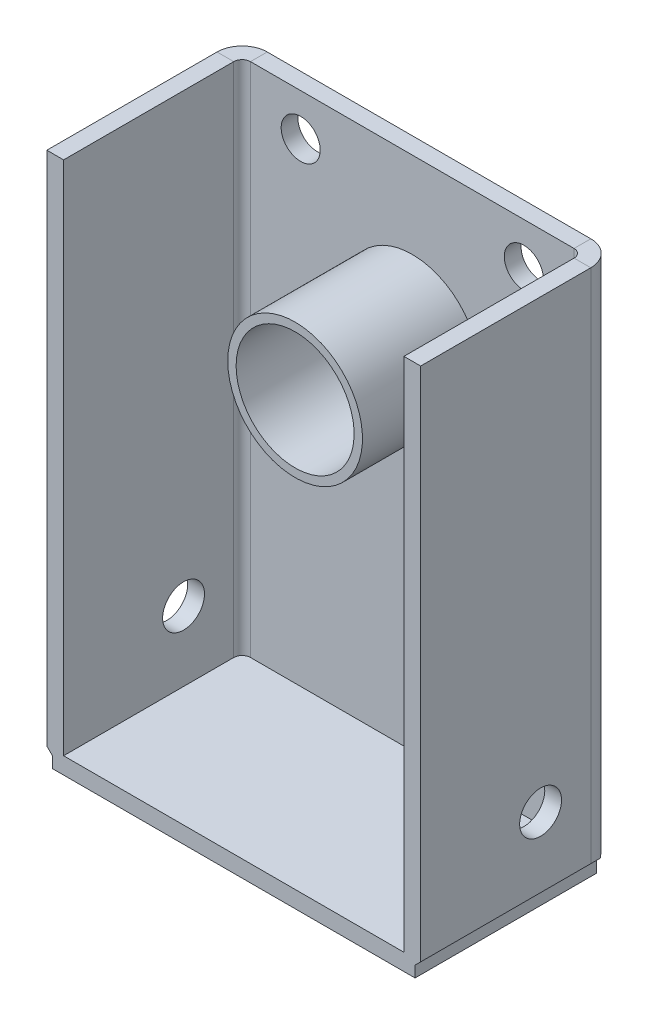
ISO-10303-21;
HEADER;
FILE_DESCRIPTION(('STEP AP214'),'2;1');
FILE_NAME('part.step','',(''),(''),'','','');
FILE_SCHEMA(('AUTOMOTIVE_DESIGN { 1 0 10303 214 1 1 1 1 }'));
ENDSEC;
DATA;
#1=APPLICATION_CONTEXT('core data for automotive mechanical design processes');
#2=APPLICATION_PROTOCOL_DEFINITION('international standard','automotive_design',2000,#1);
#3=PRODUCT_CONTEXT('',#1,'mechanical');
#4=PRODUCT('Part','Part','',(#3));
#5=PRODUCT_RELATED_PRODUCT_CATEGORY('part','',(#4));
#6=PRODUCT_DEFINITION_FORMATION('','',#4);
#7=PRODUCT_DEFINITION_CONTEXT('part definition',#1,'design');
#8=PRODUCT_DEFINITION('design','',#6,#7);
#9=PRODUCT_DEFINITION_SHAPE('','',#8);
#10=(LENGTH_UNIT() NAMED_UNIT(*) SI_UNIT(.MILLI.,.METRE.));
#11=(NAMED_UNIT(*) PLANE_ANGLE_UNIT() SI_UNIT($,.RADIAN.));
#12=(NAMED_UNIT(*) SI_UNIT($,.STERADIAN.) SOLID_ANGLE_UNIT());
#13=UNCERTAINTY_MEASURE_WITH_UNIT(LENGTH_MEASURE(1.E-05),#10,'distance_accuracy_value','');
#14=(GEOMETRIC_REPRESENTATION_CONTEXT(3) GLOBAL_UNCERTAINTY_ASSIGNED_CONTEXT((#13)) GLOBAL_UNIT_ASSIGNED_CONTEXT((#10,
#11,#12)) REPRESENTATION_CONTEXT('',''));
#15=CARTESIAN_POINT('',(0.,0.,0.));
#16=DIRECTION('',(0.,0.,1.));
#17=DIRECTION('',(1.,0.,0.));
#18=AXIS2_PLACEMENT_3D('',#15,#16,#17);
#19=CARTESIAN_POINT('',(-58.,-92.5,9.));
#20=DIRECTION('',(0.,-1.,0.));
#21=DIRECTION('',(1.,0.,0.));
#22=AXIS2_PLACEMENT_3D('',#19,#20,#21);
#23=PLANE('',#22);
#24=DIRECTION('',(0.,0.,-1.));
#25=VECTOR('',#24,1.);
#26=CARTESIAN_POINT('',(-58.,-92.5,442.719589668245));
#27=LINE('',#26,#25);
#28=CARTESIAN_POINT('',(-58.,-92.5,3.));
#29=VERTEX_POINT('',#28);
#30=CARTESIAN_POINT('',(-58.,-92.5,0.));
#31=VERTEX_POINT('',#30);
#32=EDGE_CURVE('E262',#29,#31,#27,.T.);
#33=ORIENTED_EDGE('',*,*,#32,.F.);
#34=DIRECTION('',(-1.,0.,0.));
#35=VECTOR('',#34,1.);
#36=CARTESIAN_POINT('',(-58.,-92.5,3.00000000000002));
#37=LINE('',#36,#35);
#38=CARTESIAN_POINT('',(-64.7082039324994,-92.5,3.00000000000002));
#39=VERTEX_POINT('',#38);
#40=EDGE_CURVE('E360',#29,#39,#37,.T.);
#41=ORIENTED_EDGE('',*,*,#40,.T.);
#42=CARTESIAN_POINT('',(-58.,-92.5,9.));
#43=DIRECTION('',(0.,-1.,0.));
#44=DIRECTION('',(1.,0.,0.));
#45=AXIS2_PLACEMENT_3D('',#42,#43,#44);
#46=CIRCLE('',#45,8.99999999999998);
#47=EDGE_CURVE('E229',#31,#39,#46,.F.);
#48=ORIENTED_EDGE('',*,*,#47,.F.);
#49=EDGE_LOOP('',(#33,#41,#48));
#50=FACE_BOUND('',#49,.T.);
#51=ADVANCED_FACE('F34',(#50),#23,.T.);
#52=CARTESIAN_POINT('',(0.,37.5,48.));
#53=DIRECTION('',(0.,0.,-1.));
#54=DIRECTION('',(-1.,0.,0.));
#55=AXIS2_PLACEMENT_3D('',#52,#53,#54);
#56=CYLINDRICAL_SURFACE('',#55,21.15);
#57=CARTESIAN_POINT('',(0.,37.5,48.));
#58=DIRECTION('',(0.,0.,1.));
#59=DIRECTION('',(1.,0.,0.));
#60=AXIS2_PLACEMENT_3D('',#57,#58,#59);
#61=CIRCLE('',#60,21.15);
#62=CARTESIAN_POINT('',(-21.15,37.5,48.));
#63=VERTEX_POINT('',#62);
#64=EDGE_CURVE('E345',#63,#63,#61,.T.);
#65=CARTESIAN_POINT('',(0.,37.5,3.));
#66=DIRECTION('',(0.,0.,-1.));
#67=DIRECTION('',(-1.,0.,0.));
#68=AXIS2_PLACEMENT_3D('',#65,#66,#67);
#69=CIRCLE('',#68,21.15);
#70=CARTESIAN_POINT('',(-21.15,37.5,3.00000000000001));
#71=VERTEX_POINT('',#70);
#72=EDGE_CURVE('E342',#71,#71,#69,.T.);
#73=CARTESIAN_POINT('',(-21.15,37.5,48.));
#74=CARTESIAN_POINT('',(-21.15,37.5,47.53125));
#75=CARTESIAN_POINT('',(-21.15,37.5,47.0625));
#76=CARTESIAN_POINT('',(-21.15,37.5,46.125));
#77=CARTESIAN_POINT('',(-21.15,37.5,45.65625));
#78=CARTESIAN_POINT('',(-21.15,37.5,44.71875));
#79=CARTESIAN_POINT('',(-21.15,37.5,44.25));
#80=CARTESIAN_POINT('',(-21.15,37.5,43.3125));
#81=CARTESIAN_POINT('',(-21.15,37.5,42.84375));
#82=CARTESIAN_POINT('',(-21.15,37.5,41.90625));
#83=CARTESIAN_POINT('',(-21.15,37.5,41.4375));
#84=CARTESIAN_POINT('',(-21.15,37.5,40.5));
#85=CARTESIAN_POINT('',(-21.15,37.5,40.03125));
#86=CARTESIAN_POINT('',(-21.15,37.5,39.09375));
#87=CARTESIAN_POINT('',(-21.15,37.5,38.625));
#88=CARTESIAN_POINT('',(-21.15,37.5,37.6875));
#89=CARTESIAN_POINT('',(-21.15,37.5,37.21875));
#90=CARTESIAN_POINT('',(-21.15,37.5,36.28125));
#91=CARTESIAN_POINT('',(-21.15,37.5,35.8125));
#92=CARTESIAN_POINT('',(-21.15,37.5,34.875));
#93=CARTESIAN_POINT('',(-21.15,37.5,34.40625));
#94=CARTESIAN_POINT('',(-21.15,37.5,33.46875));
#95=CARTESIAN_POINT('',(-21.15,37.5,33.));
#96=CARTESIAN_POINT('',(-21.15,37.5,32.0625));
#97=CARTESIAN_POINT('',(-21.15,37.5,31.59375));
#98=CARTESIAN_POINT('',(-21.15,37.5,30.65625));
#99=CARTESIAN_POINT('',(-21.15,37.5,30.1875));
#100=CARTESIAN_POINT('',(-21.15,37.5,29.25));
#101=CARTESIAN_POINT('',(-21.15,37.5,28.78125));
#102=CARTESIAN_POINT('',(-21.15,37.5,27.84375));
#103=CARTESIAN_POINT('',(-21.15,37.5,27.375));
#104=CARTESIAN_POINT('',(-21.15,37.5,26.4375));
#105=CARTESIAN_POINT('',(-21.15,37.5,25.96875));
#106=CARTESIAN_POINT('',(-21.15,37.5,25.03125));
#107=CARTESIAN_POINT('',(-21.15,37.5,24.5625));
#108=CARTESIAN_POINT('',(-21.15,37.5,23.625));
#109=CARTESIAN_POINT('',(-21.15,37.5,23.15625));
#110=CARTESIAN_POINT('',(-21.15,37.5,22.21875));
#111=CARTESIAN_POINT('',(-21.15,37.5,21.75));
#112=CARTESIAN_POINT('',(-21.15,37.5,20.8125));
#113=CARTESIAN_POINT('',(-21.15,37.5,20.34375));
#114=CARTESIAN_POINT('',(-21.15,37.5,19.40625));
#115=CARTESIAN_POINT('',(-21.15,37.5,18.9375));
#116=CARTESIAN_POINT('',(-21.15,37.5,18.));
#117=CARTESIAN_POINT('',(-21.15,37.5,17.53125));
#118=CARTESIAN_POINT('',(-21.15,37.5,16.59375));
#119=CARTESIAN_POINT('',(-21.15,37.5,16.125));
#120=CARTESIAN_POINT('',(-21.15,37.5,15.1875));
#121=CARTESIAN_POINT('',(-21.15,37.5,14.71875));
#122=CARTESIAN_POINT('',(-21.15,37.5,13.78125));
#123=CARTESIAN_POINT('',(-21.15,37.5,13.3125));
#124=CARTESIAN_POINT('',(-21.15,37.5,12.375));
#125=CARTESIAN_POINT('',(-21.15,37.5,11.90625));
#126=CARTESIAN_POINT('',(-21.15,37.5,10.96875));
#127=CARTESIAN_POINT('',(-21.15,37.5,10.5));
#128=CARTESIAN_POINT('',(-21.15,37.5,9.56250000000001));
#129=CARTESIAN_POINT('',(-21.15,37.5,9.09375000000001));
#130=CARTESIAN_POINT('',(-21.15,37.5,8.15625000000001));
#131=CARTESIAN_POINT('',(-21.15,37.5,7.68750000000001));
#132=CARTESIAN_POINT('',(-21.15,37.5,6.75000000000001));
#133=CARTESIAN_POINT('',(-21.15,37.5,6.28125000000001));
#134=CARTESIAN_POINT('',(-21.15,37.5,5.34375000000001));
#135=CARTESIAN_POINT('',(-21.15,37.5,4.87500000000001));
#136=CARTESIAN_POINT('',(-21.15,37.5,3.93750000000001));
#137=CARTESIAN_POINT('',(-21.15,37.5,3.46875000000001));
#138=CARTESIAN_POINT('',(-21.15,37.5,3.00000000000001));
#139=B_SPLINE_CURVE_WITH_KNOTS('',3,(#73,#74,#75,#76,#77,#78,#79,#80,#81,#82,#83,#84,#85,#86,
#87,#88,#89,#90,#91,#92,#93,#94,#95,#96,#97,#98,#99,#100,#101,#102,#103,#104,#105,#106,#107,
#108,#109,#110,#111,#112,#113,#114,#115,#116,#117,#118,#119,#120,#121,#122,#123,#124,#125,#126,
#127,#128,#129,#130,#131,#132,#133,#134,#135,#136,#137,#138),.UNSPECIFIED.,.F.,.F.,(4,2,2,2,2,2,
2,2,2,2,2,2,2,2,2,2,2,2,2,2,2,2,2,2,2,2,2,2,2,2,2,2,4),(0.,1.40625,2.8125,4.21874999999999,
5.625,7.03125,8.43749999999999,9.84374999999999,11.25,12.65625,14.0625,15.46875,16.875,18.28125,
19.6875,21.09375,22.5,23.90625,25.3125,26.71875,28.125,29.53125,30.9375,32.34375,33.75,35.15625,
36.5625,37.96875,39.375,40.78125,42.1875,43.59375,45.),.UNSPECIFIED.);
#140=EDGE_CURVE('BSEAM503',#63,#71,#139,.T.);
#141=ORIENTED_EDGE('',*,*,#64,.T.);
#142=ORIENTED_EDGE('',*,*,#72,.T.);
#143=ORIENTED_EDGE('',*,*,#140,.T.);
#144=ORIENTED_EDGE('',*,*,#140,.F.);
#145=EDGE_LOOP('',(#141,#143,#142,#144));
#146=FACE_BOUND('',#145,.T.);
#147=ADVANCED_FACE('F503',(#146),#56,.F.);
#148=CARTESIAN_POINT('',(-67.,-92.5,6.));
#149=DIRECTION('',(0.,0.,1.));
#150=DIRECTION('',(1.,0.,0.));
#151=AXIS2_PLACEMENT_3D('',#148,#149,#150);
#152=PLANE('',#151);
#153=CARTESIAN_POINT('',(-40.,-2.5,6.));
#154=DIRECTION('',(0.,0.,1.));
#155=DIRECTION('',(1.,0.,0.));
#156=AXIS2_PLACEMENT_3D('',#153,#154,#155);
#157=CIRCLE('',#156,7.);
#158=CARTESIAN_POINT('',(-33.,-2.5,6.));
#159=VERTEX_POINT('',#158);
#160=EDGE_CURVE('E231',#159,#159,#157,.T.);
#161=ORIENTED_EDGE('',*,*,#160,.F.);
#162=EDGE_LOOP('',(#161));
#163=FACE_BOUND('',#162,.T.);
#164=CARTESIAN_POINT('',(40.,77.5,6.));
#165=DIRECTION('',(0.,0.,1.));
#166=DIRECTION('',(1.,0.,0.));
#167=AXIS2_PLACEMENT_3D('',#164,#165,#166);
#168=CIRCLE('',#167,7.);
#169=CARTESIAN_POINT('',(47.,77.5,6.));
#170=VERTEX_POINT('',#169);
#171=EDGE_CURVE('E234',#170,#170,#168,.T.);
#172=ORIENTED_EDGE('',*,*,#171,.F.);
#173=EDGE_LOOP('',(#172));
#174=FACE_BOUND('',#173,.T.);
#175=CARTESIAN_POINT('',(-40.,77.5,6.));
#176=DIRECTION('',(0.,0.,1.));
#177=DIRECTION('',(1.,0.,0.));
#178=AXIS2_PLACEMENT_3D('',#175,#176,#177);
#179=CIRCLE('',#178,7.00000000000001);
#180=CARTESIAN_POINT('',(-33.,77.5,6.));
#181=VERTEX_POINT('',#180);
#182=EDGE_CURVE('E237',#181,#181,#179,.T.);
#183=ORIENTED_EDGE('',*,*,#182,.F.);
#184=EDGE_LOOP('',(#183));
#185=FACE_BOUND('',#184,.T.);
#186=CARTESIAN_POINT('',(40.,-2.5,6.));
#187=DIRECTION('',(0.,0.,1.));
#188=DIRECTION('',(1.,0.,0.));
#189=AXIS2_PLACEMENT_3D('',#186,#187,#188);
#190=CIRCLE('',#189,7.);
#191=CARTESIAN_POINT('',(47.,-2.5,6.));
#192=VERTEX_POINT('',#191);
#193=EDGE_CURVE('E240',#192,#192,#190,.T.);
#194=ORIENTED_EDGE('',*,*,#193,.F.);
#195=EDGE_LOOP('',(#194));
#196=FACE_BOUND('',#195,.T.);
#197=DIRECTION('',(1.,0.,0.));
#198=VECTOR('',#197,1.);
#199=CARTESIAN_POINT('',(-67.,-92.5,6.));
#200=LINE('',#199,#198);
#201=CARTESIAN_POINT('',(-58.,-92.5,6.));
#202=VERTEX_POINT('',#201);
#203=CARTESIAN_POINT('',(58.,-92.5,6.00000000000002));
#204=VERTEX_POINT('',#203);
#205=EDGE_CURVE('E243',#202,#204,#200,.T.);
#206=ORIENTED_EDGE('',*,*,#205,.T.);
#207=DIRECTION('',(0.,1.,0.));
#208=VECTOR('',#207,1.);
#209=CARTESIAN_POINT('',(58.,-92.5,6.00000000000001));
#210=LINE('',#209,#208);
#211=CARTESIAN_POINT('',(58.,92.5,6.));
#212=VERTEX_POINT('',#211);
#213=EDGE_CURVE('E257',#204,#212,#210,.T.);
#214=ORIENTED_EDGE('',*,*,#213,.T.);
#215=DIRECTION('',(-1.,0.,0.));
#216=VECTOR('',#215,1.);
#217=CARTESIAN_POINT('',(-67.,92.5,6.));
#218=LINE('',#217,#216);
#219=CARTESIAN_POINT('',(-58.,92.5,6.00000000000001));
#220=VERTEX_POINT('',#219);
#221=EDGE_CURVE('E251',#212,#220,#218,.T.);
#222=ORIENTED_EDGE('',*,*,#221,.T.);
#223=DIRECTION('',(0.,-1.,0.));
#224=VECTOR('',#223,1.);
#225=CARTESIAN_POINT('',(-58.,92.5,6.00000000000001));
#226=LINE('',#225,#224);
#227=EDGE_CURVE('E272',#220,#202,#226,.T.);
#228=ORIENTED_EDGE('',*,*,#227,.T.);
#229=EDGE_LOOP('',(#206,#214,#222,#228));
#230=FACE_BOUND('',#229,.T.);
#231=CARTESIAN_POINT('',(0.,37.5,6.));
#232=DIRECTION('',(0.,0.,1.));
#233=DIRECTION('',(1.,0.,0.));
#234=AXIS2_PLACEMENT_3D('',#231,#232,#233);
#235=CIRCLE('',#234,24.15);
#236=CARTESIAN_POINT('',(-24.15,37.5,6.));
#237=VERTEX_POINT('',#236);
#238=EDGE_CURVE('E415',#237,#237,#235,.T.);
#239=ORIENTED_EDGE('',*,*,#238,.F.);
#240=EDGE_LOOP('',(#239));
#241=FACE_BOUND('',#240,.T.);
#242=ADVANCED_FACE('F486',(#163,#174,#185,#196,#230,#241),#152,.T.);
#243=CARTESIAN_POINT('',(-67.,-92.5,442.719589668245));
#244=DIRECTION('',(0.,1.,0.));
#245=DIRECTION('',(0.,0.,1.));
#246=AXIS2_PLACEMENT_3D('',#243,#244,#245);
#247=PLANE('',#246);
#248=DIRECTION('',(0.,0.,-1.));
#249=VECTOR('',#248,1.);
#250=CARTESIAN_POINT('',(58.,-92.5,442.719589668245));
#251=LINE('',#250,#249);
#252=CARTESIAN_POINT('',(58.,-92.5,3.));
#253=VERTEX_POINT('',#252);
#254=CARTESIAN_POINT('',(58.,-92.5,0.));
#255=VERTEX_POINT('',#254);
#256=EDGE_CURVE('E269',#253,#255,#251,.T.);
#257=ORIENTED_EDGE('',*,*,#256,.F.);
#258=DIRECTION('',(-1.,0.,0.));
#259=VECTOR('',#258,1.);
#260=CARTESIAN_POINT('',(-58.,-92.5,3.));
#261=LINE('',#260,#259);
#262=EDGE_CURVE('E364',#253,#29,#261,.T.);
#263=ORIENTED_EDGE('',*,*,#262,.T.);
#264=ORIENTED_EDGE('',*,*,#32,.T.);
#265=DIRECTION('',(1.,0.,0.));
#266=VECTOR('',#265,1.);
#267=CARTESIAN_POINT('',(-67.,-92.5,0.));
#268=LINE('',#267,#266);
#269=EDGE_CURVE('E1018',#31,#255,#268,.T.);
#270=ORIENTED_EDGE('',*,*,#269,.T.);
#271=EDGE_LOOP('',(#257,#263,#264,#270));
#272=FACE_BOUND('',#271,.T.);
#273=ADVANCED_FACE('F517',(#272),#247,.F.);
#274=CARTESIAN_POINT('',(58.,-92.5,9.00000000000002));
#275=DIRECTION('',(0.,-1.,0.));
#276=DIRECTION('',(0.,0.,-1.));
#277=AXIS2_PLACEMENT_3D('',#274,#275,#276);
#278=PLANE('',#277);
#279=CARTESIAN_POINT('',(58.,-92.5,9.00000000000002));
#280=DIRECTION('',(0.,1.,0.));
#281=DIRECTION('',(0.,0.,1.));
#282=AXIS2_PLACEMENT_3D('',#279,#280,#281);
#283=CIRCLE('',#282,8.99999999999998);
#284=CARTESIAN_POINT('',(64.7082039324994,-92.5,3.00000000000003));
#285=VERTEX_POINT('',#284);
#286=EDGE_CURVE('E217',#285,#255,#283,.T.);
#287=ORIENTED_EDGE('',*,*,#286,.F.);
#288=DIRECTION('',(-1.,0.,0.));
#289=VECTOR('',#288,1.);
#290=CARTESIAN_POINT('',(58.,-92.5,3.00000000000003));
#291=LINE('',#290,#289);
#292=EDGE_CURVE('E362',#285,#253,#291,.T.);
#293=ORIENTED_EDGE('',*,*,#292,.T.);
#294=ORIENTED_EDGE('',*,*,#256,.T.);
#295=EDGE_LOOP('',(#287,#293,#294));
#296=FACE_BOUND('',#295,.T.);
#297=ADVANCED_FACE('F542',(#296),#278,.T.);
#298=CARTESIAN_POINT('',(-328.594661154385,92.5,70.));
#299=DIRECTION('',(0.,0.,1.));
#300=DIRECTION('',(0.,1.,0.));
#301=AXIS2_PLACEMENT_3D('',#298,#299,#300);
#302=PLANE('',#301);
#303=DIRECTION('',(0.,1.,0.));
#304=VECTOR('',#303,1.);
#305=CARTESIAN_POINT('',(67.,92.5,70.));
#306=LINE('',#305,#304);
#307=CARTESIAN_POINT('',(67.0000000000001,-92.5,70.));
#308=VERTEX_POINT('',#307);
#309=CARTESIAN_POINT('',(67.,92.5,70.));
#310=VERTEX_POINT('',#309);
#311=EDGE_CURVE('E338',#308,#310,#306,.T.);
#312=ORIENTED_EDGE('',*,*,#311,.T.);
#313=DIRECTION('',(1.,0.,0.));
#314=VECTOR('',#313,1.);
#315=CARTESIAN_POINT('',(-328.594661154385,92.5,70.));
#316=LINE('',#315,#314);
#317=CARTESIAN_POINT('',(61.,92.5,70.));
#318=VERTEX_POINT('',#317);
#319=EDGE_CURVE('E323',#318,#310,#316,.T.);
#320=ORIENTED_EDGE('',*,*,#319,.F.);
#321=DIRECTION('',(0.,-1.,0.));
#322=VECTOR('',#321,1.);
#323=CARTESIAN_POINT('',(61.,92.5,70.));
#324=LINE('',#323,#322);
#325=CARTESIAN_POINT('',(61.,-92.5,70.));
#326=VERTEX_POINT('',#325);
#327=EDGE_CURVE('E335',#318,#326,#324,.T.);
#328=ORIENTED_EDGE('',*,*,#327,.T.);
#329=DIRECTION('',(-1.,0.,0.));
#330=VECTOR('',#329,1.);
#331=CARTESIAN_POINT('',(65.,-92.5,70.));
#332=LINE('',#331,#330);
#333=CARTESIAN_POINT('',(-61.,-92.5,70.));
#334=VERTEX_POINT('',#333);
#335=EDGE_CURVE('E200',#326,#334,#332,.T.);
#336=ORIENTED_EDGE('',*,*,#335,.T.);
#337=DIRECTION('',(0.,1.,0.));
#338=VECTOR('',#337,1.);
#339=CARTESIAN_POINT('',(-61.,92.5,70.));
#340=LINE('',#339,#338);
#341=CARTESIAN_POINT('',(-61.,92.5,70.));
#342=VERTEX_POINT('',#341);
#343=EDGE_CURVE('E308',#334,#342,#340,.T.);
#344=ORIENTED_EDGE('',*,*,#343,.T.);
#345=DIRECTION('',(-1.,0.,0.));
#346=VECTOR('',#345,1.);
#347=CARTESIAN_POINT('',(328.594661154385,92.5,70.));
#348=LINE('',#347,#346);
#349=CARTESIAN_POINT('',(-67.,92.5,70.));
#350=VERTEX_POINT('',#349);
#351=EDGE_CURVE('E303',#342,#350,#348,.T.);
#352=ORIENTED_EDGE('',*,*,#351,.T.);
#353=DIRECTION('',(0.,-1.,0.));
#354=VECTOR('',#353,1.);
#355=CARTESIAN_POINT('',(-67.,92.5,70.));
#356=LINE('',#355,#354);
#357=CARTESIAN_POINT('',(-67.,-92.5,70.));
#358=VERTEX_POINT('',#357);
#359=EDGE_CURVE('E278',#350,#358,#356,.T.);
#360=ORIENTED_EDGE('',*,*,#359,.T.);
#361=DIRECTION('',(-0.70710678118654,0.707106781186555,0.));
#362=VECTOR('',#361,1.);
#363=CARTESIAN_POINT('',(-65.,-94.5,70.));
#364=LINE('',#363,#362);
#365=CARTESIAN_POINT('',(-65.,-94.5,70.));
#366=VERTEX_POINT('',#365);
#367=EDGE_CURVE('E11',#358,#366,#364,.F.);
#368=ORIENTED_EDGE('',*,*,#367,.T.);
#369=DIRECTION('',(0.,1.,0.));
#370=VECTOR('',#369,1.);
#371=CARTESIAN_POINT('',(-65.,-98.5,70.));
#372=LINE('',#371,#370);
#373=CARTESIAN_POINT('',(-65.,-98.5,70.));
#374=VERTEX_POINT('',#373);
#375=EDGE_CURVE('E187',#374,#366,#372,.T.);
#376=ORIENTED_EDGE('',*,*,#375,.F.);
#377=DIRECTION('',(-1.,0.,0.));
#378=VECTOR('',#377,1.);
#379=CARTESIAN_POINT('',(65.,-98.5,70.));
#380=LINE('',#379,#378);
#381=CARTESIAN_POINT('',(65.,-98.5,70.));
#382=VERTEX_POINT('',#381);
#383=EDGE_CURVE('E180',#382,#374,#380,.T.);
#384=ORIENTED_EDGE('',*,*,#383,.F.);
#385=DIRECTION('',(0.,1.,0.));
#386=VECTOR('',#385,1.);
#387=CARTESIAN_POINT('',(65.,-98.5,70.));
#388=LINE('',#387,#386);
#389=CARTESIAN_POINT('',(65.,-94.5,70.));
#390=VERTEX_POINT('',#389);
#391=EDGE_CURVE('E185',#382,#390,#388,.T.);
#392=ORIENTED_EDGE('',*,*,#391,.T.);
#393=DIRECTION('',(0.70710678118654,0.707106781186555,0.));
#394=VECTOR('',#393,1.);
#395=CARTESIAN_POINT('',(65.,-94.5,70.));
#396=LINE('',#395,#394);
#397=EDGE_CURVE('E377',#390,#308,#396,.T.);
#398=ORIENTED_EDGE('',*,*,#397,.T.);
#399=EDGE_LOOP('',(#312,#320,#328,#336,#344,#352,#360,#368,#376,#384,#392,#398));
#400=FACE_BOUND('',#399,.T.);
#401=ADVANCED_FACE('F183',(#400),#302,.T.);
#402=CARTESIAN_POINT('',(67.,92.5,6.));
#403=DIRECTION('',(-1.,0.,0.));
#404=DIRECTION('',(0.,-1.,0.));
#405=AXIS2_PLACEMENT_3D('',#402,#403,#404);
#406=PLANE('',#405);
#407=CARTESIAN_POINT('',(67.,-67.5,27.));
#408=DIRECTION('',(1.,0.,0.));
#409=DIRECTION('',(0.,1.,0.));
#410=AXIS2_PLACEMENT_3D('',#407,#408,#409);
#411=CIRCLE('',#410,7.5);
#412=CARTESIAN_POINT('',(67.,-60.,27.));
#413=VERTEX_POINT('',#412);
#414=EDGE_CURVE('E559',#413,#413,#411,.T.);
#415=ORIENTED_EDGE('',*,*,#414,.F.);
#416=EDGE_LOOP('',(#415));
#417=FACE_BOUND('',#416,.T.);
#418=DIRECTION('',(0.,0.,-1.));
#419=VECTOR('',#418,1.);
#420=CARTESIAN_POINT('',(67.,-92.5,6.00000000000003));
#421=LINE('',#420,#419);
#422=CARTESIAN_POINT('',(67.,-92.5,8.99999999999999));
#423=VERTEX_POINT('',#422);
#424=EDGE_CURVE('E329',#308,#423,#421,.T.);
#425=ORIENTED_EDGE('',*,*,#424,.T.);
#426=DIRECTION('',(0.,1.,0.));
#427=VECTOR('',#426,1.);
#428=CARTESIAN_POINT('',(67.,-92.5,9.00000000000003));
#429=LINE('',#428,#427);
#430=CARTESIAN_POINT('',(67.,92.5,9.));
#431=VERTEX_POINT('',#430);
#432=EDGE_CURVE('E326',#423,#431,#429,.T.);
#433=ORIENTED_EDGE('',*,*,#432,.T.);
#434=DIRECTION('',(0.,0.,-1.));
#435=VECTOR('',#434,1.);
#436=CARTESIAN_POINT('',(67.,92.5,6.));
#437=LINE('',#436,#435);
#438=EDGE_CURVE('E320',#310,#431,#437,.T.);
#439=ORIENTED_EDGE('',*,*,#438,.F.);
#440=ORIENTED_EDGE('',*,*,#311,.F.);
#441=EDGE_LOOP('',(#425,#433,#439,#440));
#442=FACE_BOUND('',#441,.T.);
#443=ADVANCED_FACE('F456',(#417,#442),#406,.F.);
#444=CARTESIAN_POINT('',(-328.594661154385,92.5,70.));
#445=DIRECTION('',(0.,-1.,0.));
#446=DIRECTION('',(0.,0.,1.));
#447=AXIS2_PLACEMENT_3D('',#444,#445,#446);
#448=PLANE('',#447);
#449=ORIENTED_EDGE('',*,*,#319,.T.);
#450=ORIENTED_EDGE('',*,*,#438,.T.);
#451=DIRECTION('',(1.,0.,0.));
#452=VECTOR('',#451,1.);
#453=CARTESIAN_POINT('',(-328.594661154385,92.4999999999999,9.00000000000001));
#454=LINE('',#453,#452);
#455=CARTESIAN_POINT('',(61.,92.5,8.99999999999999));
#456=VERTEX_POINT('',#455);
#457=EDGE_CURVE('E282',#456,#431,#454,.T.);
#458=ORIENTED_EDGE('',*,*,#457,.F.);
#459=DIRECTION('',(0.,0.,-1.));
#460=VECTOR('',#459,1.);
#461=CARTESIAN_POINT('',(61.,92.5,70.));
#462=LINE('',#461,#460);
#463=EDGE_CURVE('E317',#318,#456,#462,.T.);
#464=ORIENTED_EDGE('',*,*,#463,.F.);
#465=EDGE_LOOP('',(#449,#450,#458,#464));
#466=FACE_BOUND('',#465,.T.);
#467=ADVANCED_FACE('F459',(#466),#448,.F.);
#468=CARTESIAN_POINT('',(61.,92.5,70.));
#469=DIRECTION('',(1.,0.,0.));
#470=DIRECTION('',(0.,1.,0.));
#471=AXIS2_PLACEMENT_3D('',#468,#469,#470);
#472=PLANE('',#471);
#473=CARTESIAN_POINT('',(61.,-67.5,27.));
#474=DIRECTION('',(1.,0.,0.));
#475=DIRECTION('',(0.,1.,0.));
#476=AXIS2_PLACEMENT_3D('',#473,#474,#475);
#477=CIRCLE('',#476,7.5);
#478=CARTESIAN_POINT('',(61.,-60.,27.));
#479=VERTEX_POINT('',#478);
#480=EDGE_CURVE('E399',#479,#479,#477,.T.);
#481=ORIENTED_EDGE('',*,*,#480,.T.);
#482=EDGE_LOOP('',(#481));
#483=FACE_BOUND('',#482,.T.);
#484=ORIENTED_EDGE('',*,*,#463,.T.);
#485=DIRECTION('',(0.,-1.,0.));
#486=VECTOR('',#485,1.);
#487=CARTESIAN_POINT('',(61.,-92.5,9.00000000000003));
#488=LINE('',#487,#486);
#489=CARTESIAN_POINT('',(61.,-92.5,9.00000000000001));
#490=VERTEX_POINT('',#489);
#491=EDGE_CURVE('E313',#456,#490,#488,.T.);
#492=ORIENTED_EDGE('',*,*,#491,.T.);
#493=DIRECTION('',(0.,0.,-1.));
#494=VECTOR('',#493,1.);
#495=CARTESIAN_POINT('',(61.,-92.5,70.));
#496=LINE('',#495,#494);
#497=EDGE_CURVE('E332',#326,#490,#496,.T.);
#498=ORIENTED_EDGE('',*,*,#497,.F.);
#499=ORIENTED_EDGE('',*,*,#327,.F.);
#500=EDGE_LOOP('',(#484,#492,#498,#499));
#501=FACE_BOUND('',#500,.T.);
#502=ADVANCED_FACE('F36',(#483,#501),#472,.F.);
#503=CARTESIAN_POINT('',(328.594661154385,92.5,70.));
#504=DIRECTION('',(0.,1.,0.));
#505=DIRECTION('',(0.,0.,1.));
#506=AXIS2_PLACEMENT_3D('',#503,#504,#505);
#507=PLANE('',#506);
#508=DIRECTION('',(0.,0.,-1.));
#509=VECTOR('',#508,1.);
#510=CARTESIAN_POINT('',(-67.,92.5,6.00000000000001));
#511=LINE('',#510,#509);
#512=CARTESIAN_POINT('',(-67.,92.5,8.99999999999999));
#513=VERTEX_POINT('',#512);
#514=EDGE_CURVE('E294',#350,#513,#511,.T.);
#515=ORIENTED_EDGE('',*,*,#514,.F.);
#516=ORIENTED_EDGE('',*,*,#351,.F.);
#517=DIRECTION('',(0.,0.,-1.));
#518=VECTOR('',#517,1.);
#519=CARTESIAN_POINT('',(-61.,92.5,70.));
#520=LINE('',#519,#518);
#521=CARTESIAN_POINT('',(-61.,92.5,9.));
#522=VERTEX_POINT('',#521);
#523=EDGE_CURVE('E300',#342,#522,#520,.T.);
#524=ORIENTED_EDGE('',*,*,#523,.T.);
#525=DIRECTION('',(-1.,0.,0.));
#526=VECTOR('',#525,1.);
#527=CARTESIAN_POINT('',(328.594661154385,92.5,9.00000000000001));
#528=LINE('',#527,#526);
#529=EDGE_CURVE('E297',#522,#513,#528,.T.);
#530=ORIENTED_EDGE('',*,*,#529,.T.);
#531=EDGE_LOOP('',(#515,#516,#524,#530));
#532=FACE_BOUND('',#531,.T.);
#533=ADVANCED_FACE('F471',(#532),#507,.T.);
#534=CARTESIAN_POINT('',(-67.,92.5,6.00000000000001));
#535=DIRECTION('',(1.,0.,0.));
#536=DIRECTION('',(0.,1.,0.));
#537=AXIS2_PLACEMENT_3D('',#534,#535,#536);
#538=PLANE('',#537);
#539=CARTESIAN_POINT('',(-67.,-67.5,27.));
#540=DIRECTION('',(1.,0.,0.));
#541=DIRECTION('',(0.,1.,0.));
#542=AXIS2_PLACEMENT_3D('',#539,#540,#541);
#543=CIRCLE('',#542,7.5);
#544=CARTESIAN_POINT('',(-67.,-60.,27.));
#545=VERTEX_POINT('',#544);
#546=EDGE_CURVE('E561',#545,#545,#543,.T.);
#547=ORIENTED_EDGE('',*,*,#546,.T.);
#548=EDGE_LOOP('',(#547));
#549=FACE_BOUND('',#548,.T.);
#550=ORIENTED_EDGE('',*,*,#514,.T.);
#551=DIRECTION('',(0.,-1.,0.));
#552=VECTOR('',#551,1.);
#553=CARTESIAN_POINT('',(-67.,92.5,9.00000000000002));
#554=LINE('',#553,#552);
#555=CARTESIAN_POINT('',(-67.,-92.5,8.99999999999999));
#556=VERTEX_POINT('',#555);
#557=EDGE_CURVE('E291',#513,#556,#554,.T.);
#558=ORIENTED_EDGE('',*,*,#557,.T.);
#559=DIRECTION('',(0.,0.,-1.));
#560=VECTOR('',#559,1.);
#561=CARTESIAN_POINT('',(-67.,-92.5,6.));
#562=LINE('',#561,#560);
#563=EDGE_CURVE('E286',#358,#556,#562,.T.);
#564=ORIENTED_EDGE('',*,*,#563,.F.);
#565=ORIENTED_EDGE('',*,*,#359,.F.);
#566=EDGE_LOOP('',(#550,#558,#564,#565));
#567=FACE_BOUND('',#566,.T.);
#568=ADVANCED_FACE('F390',(#549,#567),#538,.F.);
#569=CARTESIAN_POINT('',(-61.,92.5,70.));
#570=DIRECTION('',(-1.,0.,0.));
#571=DIRECTION('',(0.,-1.,0.));
#572=AXIS2_PLACEMENT_3D('',#569,#570,#571);
#573=PLANE('',#572);
#574=CARTESIAN_POINT('',(-61.,-67.5,27.));
#575=DIRECTION('',(-1.,0.,0.));
#576=DIRECTION('',(0.,-1.,0.));
#577=AXIS2_PLACEMENT_3D('',#574,#575,#576);
#578=CIRCLE('',#577,7.5);
#579=CARTESIAN_POINT('',(-61.,-75.,27.));
#580=VERTEX_POINT('',#579);
#581=EDGE_CURVE('E38',#580,#580,#578,.T.);
#582=ORIENTED_EDGE('',*,*,#581,.T.);
#583=EDGE_LOOP('',(#582));
#584=FACE_BOUND('',#583,.T.);
#585=DIRECTION('',(0.,0.,-1.));
#586=VECTOR('',#585,1.);
#587=CARTESIAN_POINT('',(-61.,-92.5,70.));
#588=LINE('',#587,#586);
#589=CARTESIAN_POINT('',(-61.,-92.5,8.99999999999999));
#590=VERTEX_POINT('',#589);
#591=EDGE_CURVE('E283',#334,#590,#588,.T.);
#592=ORIENTED_EDGE('',*,*,#591,.T.);
#593=DIRECTION('',(0.,1.,0.));
#594=VECTOR('',#593,1.);
#595=CARTESIAN_POINT('',(-61.,92.5,9.00000000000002));
#596=LINE('',#595,#594);
#597=EDGE_CURVE('E279',#590,#522,#596,.T.);
#598=ORIENTED_EDGE('',*,*,#597,.T.);
#599=ORIENTED_EDGE('',*,*,#523,.F.);
#600=ORIENTED_EDGE('',*,*,#343,.F.);
#601=EDGE_LOOP('',(#592,#598,#599,#600));
#602=FACE_BOUND('',#601,.T.);
#603=ADVANCED_FACE('F468',(#584,#602),#573,.F.);
#604=CARTESIAN_POINT('',(-67.,-92.5,0.));
#605=DIRECTION('',(0.,0.,1.));
#606=DIRECTION('',(1.,0.,0.));
#607=AXIS2_PLACEMENT_3D('',#604,#605,#606);
#608=PLANE('',#607);
#609=CARTESIAN_POINT('',(0.,37.5,0.));
#610=DIRECTION('',(0.,0.,-1.));
#611=DIRECTION('',(-1.,0.,0.));
#612=AXIS2_PLACEMENT_3D('',#609,#610,#611);
#613=CIRCLE('',#612,24.25);
#614=CARTESIAN_POINT('',(-24.25,37.5,0.));
#615=VERTEX_POINT('',#614);
#616=EDGE_CURVE('E346',#615,#615,#613,.T.);
#617=ORIENTED_EDGE('',*,*,#616,.F.);
#618=EDGE_LOOP('',(#617));
#619=FACE_BOUND('',#618,.T.);
#620=CARTESIAN_POINT('',(40.,-2.5,0.));
#621=DIRECTION('',(0.,0.,1.));
#622=DIRECTION('',(1.,0.,0.));
#623=AXIS2_PLACEMENT_3D('',#620,#621,#622);
#624=CIRCLE('',#623,7.);
#625=CARTESIAN_POINT('',(47.,-2.5,0.));
#626=VERTEX_POINT('',#625);
#627=EDGE_CURVE('E1022',#626,#626,#624,.T.);
#628=ORIENTED_EDGE('',*,*,#627,.T.);
#629=EDGE_LOOP('',(#628));
#630=FACE_BOUND('',#629,.T.);
#631=CARTESIAN_POINT('',(-40.,77.5,0.));
#632=DIRECTION('',(0.,0.,1.));
#633=DIRECTION('',(1.,0.,0.));
#634=AXIS2_PLACEMENT_3D('',#631,#632,#633);
#635=CIRCLE('',#634,7.00000000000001);
#636=CARTESIAN_POINT('',(-33.,77.5,0.));
#637=VERTEX_POINT('',#636);
#638=EDGE_CURVE('E1019',#637,#637,#635,.T.);
#639=ORIENTED_EDGE('',*,*,#638,.T.);
#640=EDGE_LOOP('',(#639));
#641=FACE_BOUND('',#640,.T.);
#642=CARTESIAN_POINT('',(40.,77.5,0.));
#643=DIRECTION('',(0.,0.,1.));
#644=DIRECTION('',(1.,0.,0.));
#645=AXIS2_PLACEMENT_3D('',#642,#643,#644);
#646=CIRCLE('',#645,7.);
#647=CARTESIAN_POINT('',(47.,77.5,0.));
#648=VERTEX_POINT('',#647);
#649=EDGE_CURVE('E252',#648,#648,#646,.T.);
#650=ORIENTED_EDGE('',*,*,#649,.T.);
#651=EDGE_LOOP('',(#650));
#652=FACE_BOUND('',#651,.T.);
#653=CARTESIAN_POINT('',(-40.,-2.5,0.));
#654=DIRECTION('',(0.,0.,1.));
#655=DIRECTION('',(1.,0.,0.));
#656=AXIS2_PLACEMENT_3D('',#653,#654,#655);
#657=CIRCLE('',#656,7.);
#658=CARTESIAN_POINT('',(-33.,-2.5,0.));
#659=VERTEX_POINT('',#658);
#660=EDGE_CURVE('E256',#659,#659,#657,.T.);
#661=ORIENTED_EDGE('',*,*,#660,.T.);
#662=EDGE_LOOP('',(#661));
#663=FACE_BOUND('',#662,.T.);
#664=DIRECTION('',(0.,1.,0.));
#665=VECTOR('',#664,1.);
#666=CARTESIAN_POINT('',(58.,-92.5,0.));
#667=LINE('',#666,#665);
#668=CARTESIAN_POINT('',(58.,92.5,0.));
#669=VERTEX_POINT('',#668);
#670=EDGE_CURVE('E260',#255,#669,#667,.T.);
#671=ORIENTED_EDGE('',*,*,#670,.F.);
#672=ORIENTED_EDGE('',*,*,#269,.F.);
#673=DIRECTION('',(0.,-1.,0.));
#674=VECTOR('',#673,1.);
#675=CARTESIAN_POINT('',(-58.,92.5,0.));
#676=LINE('',#675,#674);
#677=CARTESIAN_POINT('',(-58.,92.5,0.));
#678=VERTEX_POINT('',#677);
#679=EDGE_CURVE('E275',#678,#31,#676,.T.);
#680=ORIENTED_EDGE('',*,*,#679,.F.);
#681=DIRECTION('',(-1.,0.,0.));
#682=VECTOR('',#681,1.);
#683=CARTESIAN_POINT('',(-67.,92.5,0.));
#684=LINE('',#683,#682);
#685=EDGE_CURVE('E485',#669,#678,#684,.T.);
#686=ORIENTED_EDGE('',*,*,#685,.F.);
#687=EDGE_LOOP('',(#671,#672,#680,#686));
#688=FACE_BOUND('',#687,.T.);
#689=ADVANCED_FACE('F524',(#619,#630,#641,#652,#663,#688),#608,.F.);
#690=CARTESIAN_POINT('',(40.,77.5,6.));
#691=DIRECTION('',(0.,0.,-1.));
#692=DIRECTION('',(-1.,0.,0.));
#693=AXIS2_PLACEMENT_3D('',#690,#691,#692);
#694=CYLINDRICAL_SURFACE('',#693,7.);
#695=ORIENTED_EDGE('',*,*,#171,.T.);
#696=EDGE_LOOP('',(#695));
#697=FACE_BOUND('',#696,.T.);
#698=ORIENTED_EDGE('',*,*,#649,.F.);
#699=EDGE_LOOP('',(#698));
#700=FACE_BOUND('',#699,.T.);
#701=ADVANCED_FACE('F527',(#697,#700),#694,.F.);
#702=CARTESIAN_POINT('',(-40.,77.5,6.));
#703=DIRECTION('',(0.,0.,-1.));
#704=DIRECTION('',(-1.,0.,0.));
#705=AXIS2_PLACEMENT_3D('',#702,#703,#704);
#706=CYLINDRICAL_SURFACE('',#705,7.00000000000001);
#707=ORIENTED_EDGE('',*,*,#182,.T.);
#708=EDGE_LOOP('',(#707));
#709=FACE_BOUND('',#708,.T.);
#710=ORIENTED_EDGE('',*,*,#638,.F.);
#711=EDGE_LOOP('',(#710));
#712=FACE_BOUND('',#711,.T.);
#713=ADVANCED_FACE('F531',(#709,#712),#706,.F.);
#714=CARTESIAN_POINT('',(40.,-2.5,6.));
#715=DIRECTION('',(0.,0.,-1.));
#716=DIRECTION('',(-1.,0.,0.));
#717=AXIS2_PLACEMENT_3D('',#714,#715,#716);
#718=CYLINDRICAL_SURFACE('',#717,7.);
#719=ORIENTED_EDGE('',*,*,#193,.T.);
#720=EDGE_LOOP('',(#719));
#721=FACE_BOUND('',#720,.T.);
#722=ORIENTED_EDGE('',*,*,#627,.F.);
#723=EDGE_LOOP('',(#722));
#724=FACE_BOUND('',#723,.T.);
#725=ADVANCED_FACE('F522',(#721,#724),#718,.F.);
#726=CARTESIAN_POINT('',(-40.,-2.5,6.));
#727=DIRECTION('',(0.,0.,-1.));
#728=DIRECTION('',(-1.,0.,0.));
#729=AXIS2_PLACEMENT_3D('',#726,#727,#728);
#730=CYLINDRICAL_SURFACE('',#729,7.);
#731=ORIENTED_EDGE('',*,*,#160,.T.);
#732=EDGE_LOOP('',(#731));
#733=FACE_BOUND('',#732,.T.);
#734=ORIENTED_EDGE('',*,*,#660,.F.);
#735=EDGE_LOOP('',(#734));
#736=FACE_BOUND('',#735,.T.);
#737=ADVANCED_FACE('F519',(#733,#736),#730,.F.);
#738=CARTESIAN_POINT('',(-67.,92.5,442.719589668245));
#739=DIRECTION('',(0.,-1.,0.));
#740=DIRECTION('',(0.,0.,-1.));
#741=AXIS2_PLACEMENT_3D('',#738,#739,#740);
#742=PLANE('',#741);
#743=DIRECTION('',(0.,0.,-1.));
#744=VECTOR('',#743,1.);
#745=CARTESIAN_POINT('',(58.,92.5,442.719589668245));
#746=LINE('',#745,#744);
#747=EDGE_CURVE('E266',#212,#669,#746,.T.);
#748=ORIENTED_EDGE('',*,*,#747,.T.);
#749=ORIENTED_EDGE('',*,*,#685,.T.);
#750=DIRECTION('',(0.,0.,-1.));
#751=VECTOR('',#750,1.);
#752=CARTESIAN_POINT('',(-58.,92.5,442.719589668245));
#753=LINE('',#752,#751);
#754=EDGE_CURVE('E264',#220,#678,#753,.T.);
#755=ORIENTED_EDGE('',*,*,#754,.F.);
#756=ORIENTED_EDGE('',*,*,#221,.F.);
#757=EDGE_LOOP('',(#748,#749,#755,#756));
#758=FACE_BOUND('',#757,.T.);
#759=ADVANCED_FACE('F483',(#758),#742,.F.);
#760=CARTESIAN_POINT('',(-58.,92.5,9.00000000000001));
#761=DIRECTION('',(0.,1.,0.));
#762=DIRECTION('',(-1.,0.,0.));
#763=AXIS2_PLACEMENT_3D('',#760,#761,#762);
#764=PLANE('',#763);
#765=ORIENTED_EDGE('',*,*,#529,.F.);
#766=CARTESIAN_POINT('',(-58.,92.5,9.00000000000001));
#767=DIRECTION('',(0.,-1.,0.));
#768=DIRECTION('',(1.,0.,0.));
#769=AXIS2_PLACEMENT_3D('',#766,#767,#768);
#770=CIRCLE('',#769,3.);
#771=EDGE_CURVE('E221',#522,#220,#770,.T.);
#772=ORIENTED_EDGE('',*,*,#771,.T.);
#773=ORIENTED_EDGE('',*,*,#754,.T.);
#774=CARTESIAN_POINT('',(-58.,92.5,9.00000000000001));
#775=DIRECTION('',(0.,-1.,0.));
#776=DIRECTION('',(1.,0.,0.));
#777=AXIS2_PLACEMENT_3D('',#774,#775,#776);
#778=CIRCLE('',#777,8.99999999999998);
#779=EDGE_CURVE('E226',#513,#678,#778,.T.);
#780=ORIENTED_EDGE('',*,*,#779,.F.);
#781=EDGE_LOOP('',(#765,#772,#773,#780));
#782=FACE_BOUND('',#781,.T.);
#783=ADVANCED_FACE('F474',(#782),#764,.T.);
#784=CARTESIAN_POINT('',(-58.,401.52860314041,9.00000000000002));
#785=DIRECTION('',(0.,-1.,0.));
#786=DIRECTION('',(1.,0.,0.));
#787=AXIS2_PLACEMENT_3D('',#784,#785,#786);
#788=CYLINDRICAL_SURFACE('',#787,8.99999999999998);
#789=ORIENTED_EDGE('',*,*,#779,.T.);
#790=ORIENTED_EDGE('',*,*,#679,.T.);
#791=ORIENTED_EDGE('',*,*,#47,.T.);
#792=CARTESIAN_POINT('',(-58.,-98.5000000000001,9.));
#793=DIRECTION('',(0.,0.707106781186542,0.707106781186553));
#794=DIRECTION('',(0.,-0.707106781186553,0.707106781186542));
#795=AXIS2_PLACEMENT_3D('',#792,#793,#794);
#796=ELLIPSE('',#795,12.7279220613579,8.99999999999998);
#797=CARTESIAN_POINT('',(-65.6846584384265,-93.8153415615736,4.31534156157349));
#798=VERTEX_POINT('',#797);
#799=EDGE_CURVE('E50',#39,#798,#796,.T.);
#800=ORIENTED_EDGE('',*,*,#799,.T.);
#801=CARTESIAN_POINT('',(-58.,-101.5,9.));
#802=DIRECTION('',(0.707106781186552,0.707106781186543,0.));
#803=DIRECTION('',(0.707106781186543,-0.707106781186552,0.));
#804=AXIS2_PLACEMENT_3D('',#801,#802,#803);
#805=ELLIPSE('',#804,12.7279220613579,8.99999999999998);
#806=EDGE_CURVE('E43',#798,#556,#805,.T.);
#807=ORIENTED_EDGE('',*,*,#806,.T.);
#808=ORIENTED_EDGE('',*,*,#557,.F.);
#809=EDGE_LOOP('',(#789,#790,#791,#800,#807,#808));
#810=FACE_BOUND('',#809,.T.);
#811=ADVANCED_FACE('F385',(#810),#788,.T.);
#812=CARTESIAN_POINT('',(-58.,401.52860314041,9.00000000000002));
#813=DIRECTION('',(0.,-1.,0.));
#814=DIRECTION('',(1.,0.,0.));
#815=AXIS2_PLACEMENT_3D('',#812,#813,#814);
#816=CYLINDRICAL_SURFACE('',#815,3.);
#817=ORIENTED_EDGE('',*,*,#771,.F.);
#818=ORIENTED_EDGE('',*,*,#597,.F.);
#819=CARTESIAN_POINT('',(-58.,-92.5,9.));
#820=DIRECTION('',(0.,-1.,0.));
#821=DIRECTION('',(1.,0.,0.));
#822=AXIS2_PLACEMENT_3D('',#819,#820,#821);
#823=CIRCLE('',#822,3.);
#824=EDGE_CURVE('E223',#202,#590,#823,.F.);
#825=ORIENTED_EDGE('',*,*,#824,.F.);
#826=ORIENTED_EDGE('',*,*,#227,.F.);
#827=EDGE_LOOP('',(#817,#818,#825,#826));
#828=FACE_BOUND('',#827,.T.);
#829=ADVANCED_FACE('F477',(#828),#816,.F.);
#830=CARTESIAN_POINT('',(58.,92.5,9.));
#831=DIRECTION('',(0.,1.,0.));
#832=DIRECTION('',(0.,0.,1.));
#833=AXIS2_PLACEMENT_3D('',#830,#831,#832);
#834=PLANE('',#833);
#835=ORIENTED_EDGE('',*,*,#747,.F.);
#836=CARTESIAN_POINT('',(58.,92.5,9.));
#837=DIRECTION('',(0.,1.,0.));
#838=DIRECTION('',(0.,0.,1.));
#839=AXIS2_PLACEMENT_3D('',#836,#837,#838);
#840=CIRCLE('',#839,3.);
#841=EDGE_CURVE('E209',#212,#456,#840,.F.);
#842=ORIENTED_EDGE('',*,*,#841,.T.);
#843=ORIENTED_EDGE('',*,*,#457,.T.);
#844=CARTESIAN_POINT('',(58.,92.5,9.));
#845=DIRECTION('',(0.,1.,0.));
#846=DIRECTION('',(0.,0.,1.));
#847=AXIS2_PLACEMENT_3D('',#844,#845,#846);
#848=CIRCLE('',#847,8.99999999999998);
#849=EDGE_CURVE('E219',#669,#431,#848,.F.);
#850=ORIENTED_EDGE('',*,*,#849,.F.);
#851=EDGE_LOOP('',(#835,#842,#843,#850));
#852=FACE_BOUND('',#851,.T.);
#853=ADVANCED_FACE('F493',(#852),#834,.T.);
#854=CARTESIAN_POINT('',(58.,-367.278829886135,9.00000000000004));
#855=DIRECTION('',(0.,1.,0.));
#856=DIRECTION('',(0.,0.,1.));
#857=AXIS2_PLACEMENT_3D('',#854,#855,#856);
#858=CYLINDRICAL_SURFACE('',#857,8.99999999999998);
#859=ORIENTED_EDGE('',*,*,#432,.F.);
#860=CARTESIAN_POINT('',(58.,-101.5,9.00000000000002));
#861=DIRECTION('',(-0.707106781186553,0.707106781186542,0.));
#862=DIRECTION('',(0.707106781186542,0.707106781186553,0.));
#863=AXIS2_PLACEMENT_3D('',#860,#861,#862);
#864=ELLIPSE('',#863,12.7279220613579,8.99999999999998);
#865=CARTESIAN_POINT('',(65.6846584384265,-93.8153415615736,4.31534156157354));
#866=VERTEX_POINT('',#865);
#867=EDGE_CURVE('E372',#423,#866,#864,.T.);
#868=ORIENTED_EDGE('',*,*,#867,.T.);
#869=CARTESIAN_POINT('',(58.,-98.5000000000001,9.00000000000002));
#870=DIRECTION('',(0.,0.707106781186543,0.707106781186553));
#871=DIRECTION('',(0.,0.707106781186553,-0.707106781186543));
#872=AXIS2_PLACEMENT_3D('',#869,#870,#871);
#873=ELLIPSE('',#872,12.7279220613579,8.99999999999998);
#874=EDGE_CURVE('E367',#866,#285,#873,.T.);
#875=ORIENTED_EDGE('',*,*,#874,.T.);
#876=ORIENTED_EDGE('',*,*,#286,.T.);
#877=ORIENTED_EDGE('',*,*,#670,.T.);
#878=ORIENTED_EDGE('',*,*,#849,.T.);
#879=EDGE_LOOP('',(#859,#868,#875,#876,#877,#878));
#880=FACE_BOUND('',#879,.T.);
#881=ADVANCED_FACE('F624',(#880),#858,.T.);
#882=CARTESIAN_POINT('',(58.,-367.278829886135,9.00000000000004));
#883=DIRECTION('',(0.,1.,0.));
#884=DIRECTION('',(0.,0.,1.));
#885=AXIS2_PLACEMENT_3D('',#882,#883,#884);
#886=CYLINDRICAL_SURFACE('',#885,3.);
#887=CARTESIAN_POINT('',(58.,-92.5,9.00000000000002));
#888=DIRECTION('',(0.,1.,0.));
#889=DIRECTION('',(0.,0.,1.));
#890=AXIS2_PLACEMENT_3D('',#887,#888,#889);
#891=CIRCLE('',#890,3.);
#892=EDGE_CURVE('E206',#490,#204,#891,.T.);
#893=ORIENTED_EDGE('',*,*,#892,.F.);
#894=ORIENTED_EDGE('',*,*,#491,.F.);
#895=ORIENTED_EDGE('',*,*,#841,.F.);
#896=ORIENTED_EDGE('',*,*,#213,.F.);
#897=EDGE_LOOP('',(#893,#894,#895,#896));
#898=FACE_BOUND('',#897,.T.);
#899=ADVANCED_FACE('F491',(#898),#886,.F.);
#900=CARTESIAN_POINT('',(65.,-92.5,70.));
#901=DIRECTION('',(0.,1.,0.));
#902=DIRECTION('',(0.,0.,1.));
#903=AXIS2_PLACEMENT_3D('',#900,#901,#902);
#904=PLANE('',#903);
#905=ORIENTED_EDGE('',*,*,#591,.F.);
#906=ORIENTED_EDGE('',*,*,#335,.F.);
#907=ORIENTED_EDGE('',*,*,#497,.T.);
#908=ORIENTED_EDGE('',*,*,#892,.T.);
#909=ORIENTED_EDGE('',*,*,#205,.F.);
#910=ORIENTED_EDGE('',*,*,#824,.T.);
#911=EDGE_LOOP('',(#905,#906,#907,#908,#909,#910));
#912=FACE_BOUND('',#911,.T.);
#913=ADVANCED_FACE('F465',(#912),#904,.T.);
#914=CARTESIAN_POINT('',(65.,-98.5,70.));
#915=DIRECTION('',(-1.,0.,0.));
#916=DIRECTION('',(0.,0.,1.));
#917=AXIS2_PLACEMENT_3D('',#914,#915,#916);
#918=PLANE('',#917);
#919=DIRECTION('',(0.,1.,0.));
#920=VECTOR('',#919,1.);
#921=CARTESIAN_POINT('',(65.,-98.5,5.00000000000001));
#922=LINE('',#921,#920);
#923=CARTESIAN_POINT('',(65.,-98.5,5.00000000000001));
#924=VERTEX_POINT('',#923);
#925=CARTESIAN_POINT('',(65.,-94.5,5.00000000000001));
#926=VERTEX_POINT('',#925);
#927=EDGE_CURVE('E425',#924,#926,#922,.T.);
#928=ORIENTED_EDGE('',*,*,#927,.T.);
#929=DIRECTION('',(0.,0.,1.));
#930=VECTOR('',#929,1.);
#931=CARTESIAN_POINT('',(65.,-94.5000000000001,70.));
#932=LINE('',#931,#930);
#933=CARTESIAN_POINT('',(65.,-94.5,9.00000000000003));
#934=VERTEX_POINT('',#933);
#935=EDGE_CURVE('E370',#926,#934,#932,.T.);
#936=ORIENTED_EDGE('',*,*,#935,.T.);
#937=DIRECTION('',(0.,0.,1.));
#938=VECTOR('',#937,1.);
#939=CARTESIAN_POINT('',(65.,-94.5,70.));
#940=LINE('',#939,#938);
#941=EDGE_CURVE('E205',#934,#390,#940,.T.);
#942=ORIENTED_EDGE('',*,*,#941,.T.);
#943=ORIENTED_EDGE('',*,*,#391,.F.);
#944=DIRECTION('',(0.,0.,1.));
#945=VECTOR('',#944,1.);
#946=CARTESIAN_POINT('',(65.,-98.5,70.));
#947=LINE('',#946,#945);
#948=EDGE_CURVE('E191',#924,#382,#947,.T.);
#949=ORIENTED_EDGE('',*,*,#948,.F.);
#950=EDGE_LOOP('',(#928,#936,#942,#943,#949));
#951=FACE_BOUND('',#950,.T.);
#952=ADVANCED_FACE('F202',(#951),#918,.F.);
#953=CARTESIAN_POINT('',(-65.,-98.5,70.));
#954=DIRECTION('',(1.,0.,0.));
#955=DIRECTION('',(0.,0.,-1.));
#956=AXIS2_PLACEMENT_3D('',#953,#954,#955);
#957=PLANE('',#956);
#958=DIRECTION('',(0.,0.,-1.));
#959=VECTOR('',#958,1.);
#960=CARTESIAN_POINT('',(-65.,-94.5,9.00000000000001));
#961=LINE('',#960,#959);
#962=CARTESIAN_POINT('',(-65.,-94.5,8.99999999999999));
#963=VERTEX_POINT('',#962);
#964=EDGE_CURVE('E58',#366,#963,#961,.T.);
#965=ORIENTED_EDGE('',*,*,#964,.T.);
#966=DIRECTION('',(0.,0.,-1.));
#967=VECTOR('',#966,1.);
#968=CARTESIAN_POINT('',(-65.,-94.5000000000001,70.));
#969=LINE('',#968,#967);
#970=CARTESIAN_POINT('',(-65.,-94.5000000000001,5.));
#971=VERTEX_POINT('',#970);
#972=EDGE_CURVE('E380',#963,#971,#969,.T.);
#973=ORIENTED_EDGE('',*,*,#972,.T.);
#974=DIRECTION('',(0.,1.,0.));
#975=VECTOR('',#974,1.);
#976=CARTESIAN_POINT('',(-65.,-98.5,5.));
#977=LINE('',#976,#975);
#978=CARTESIAN_POINT('',(-65.,-98.5,5.));
#979=VERTEX_POINT('',#978);
#980=EDGE_CURVE('E211',#979,#971,#977,.T.);
#981=ORIENTED_EDGE('',*,*,#980,.F.);
#982=DIRECTION('',(0.,0.,-1.));
#983=VECTOR('',#982,1.);
#984=CARTESIAN_POINT('',(-65.,-98.5,70.));
#985=LINE('',#984,#983);
#986=EDGE_CURVE('E190',#374,#979,#985,.T.);
#987=ORIENTED_EDGE('',*,*,#986,.F.);
#988=ORIENTED_EDGE('',*,*,#375,.T.);
#989=EDGE_LOOP('',(#965,#973,#981,#987,#988));
#990=FACE_BOUND('',#989,.T.);
#991=ADVANCED_FACE('F617',(#990),#957,.F.);
#992=CARTESIAN_POINT('',(65.,-98.5,5.00000000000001));
#993=DIRECTION('',(0.,0.,1.));
#994=DIRECTION('',(1.,0.,0.));
#995=AXIS2_PLACEMENT_3D('',#992,#993,#994);
#996=PLANE('',#995);
#997=ORIENTED_EDGE('',*,*,#980,.T.);
#998=DIRECTION('',(1.,0.,0.));
#999=VECTOR('',#998,1.);
#1000=CARTESIAN_POINT('',(65.,-94.4999999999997,5.00000000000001));
#1001=LINE('',#1000,#999);
#1002=CARTESIAN_POINT('',(-58.,-94.5,5.00000000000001));
#1003=VERTEX_POINT('',#1002);
#1004=EDGE_CURVE('E357',#971,#1003,#1001,.T.);
#1005=ORIENTED_EDGE('',*,*,#1004,.T.);
#1006=DIRECTION('',(1.,0.,0.));
#1007=VECTOR('',#1006,1.);
#1008=CARTESIAN_POINT('',(58.,-94.5,5.00000000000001));
#1009=LINE('',#1008,#1007);
#1010=CARTESIAN_POINT('',(58.,-94.5,5.00000000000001));
#1011=VERTEX_POINT('',#1010);
#1012=EDGE_CURVE('E352',#1003,#1011,#1009,.T.);
#1013=ORIENTED_EDGE('',*,*,#1012,.T.);
#1014=DIRECTION('',(1.,0.,0.));
#1015=VECTOR('',#1014,1.);
#1016=CARTESIAN_POINT('',(65.,-94.5,5.00000000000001));
#1017=LINE('',#1016,#1015);
#1018=EDGE_CURVE('E354',#1011,#926,#1017,.T.);
#1019=ORIENTED_EDGE('',*,*,#1018,.T.);
#1020=ORIENTED_EDGE('',*,*,#927,.F.);
#1021=DIRECTION('',(1.,0.,0.));
#1022=VECTOR('',#1021,1.);
#1023=CARTESIAN_POINT('',(65.,-98.5,5.00000000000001));
#1024=LINE('',#1023,#1022);
#1025=EDGE_CURVE('E196',#979,#924,#1024,.T.);
#1026=ORIENTED_EDGE('',*,*,#1025,.F.);
#1027=EDGE_LOOP('',(#997,#1005,#1013,#1019,#1020,#1026));
#1028=FACE_BOUND('',#1027,.T.);
#1029=ADVANCED_FACE('F430',(#1028),#996,.F.);
#1030=CARTESIAN_POINT('',(65.,-98.5,70.));
#1031=DIRECTION('',(0.,1.,0.));
#1032=DIRECTION('',(0.,0.,1.));
#1033=AXIS2_PLACEMENT_3D('',#1030,#1031,#1032);
#1034=PLANE('',#1033);
#1035=ORIENTED_EDGE('',*,*,#948,.T.);
#1036=ORIENTED_EDGE('',*,*,#383,.T.);
#1037=ORIENTED_EDGE('',*,*,#986,.T.);
#1038=ORIENTED_EDGE('',*,*,#1025,.T.);
#1039=EDGE_LOOP('',(#1035,#1036,#1037,#1038));
#1040=FACE_BOUND('',#1039,.T.);
#1041=ADVANCED_FACE('F194',(#1040),#1034,.F.);
#1042=CARTESIAN_POINT('',(0.,37.5,48.));
#1043=DIRECTION('',(0.,0.,1.));
#1044=DIRECTION('',(1.,0.,0.));
#1045=AXIS2_PLACEMENT_3D('',#1042,#1043,#1044);
#1046=PLANE('',#1045);
#1047=CARTESIAN_POINT('',(0.,37.5,48.));
#1048=DIRECTION('',(0.,0.,1.));
#1049=DIRECTION('',(1.,0.,0.));
#1050=AXIS2_PLACEMENT_3D('',#1047,#1048,#1049);
#1051=CIRCLE('',#1050,24.15);
#1052=CARTESIAN_POINT('',(-24.15,37.5,48.));
#1053=VERTEX_POINT('',#1052);
#1054=EDGE_CURVE('E418',#1053,#1053,#1051,.T.);
#1055=ORIENTED_EDGE('',*,*,#1054,.T.);
#1056=EDGE_LOOP('',(#1055));
#1057=FACE_BOUND('',#1056,.T.);
#1058=ORIENTED_EDGE('',*,*,#64,.F.);
#1059=EDGE_LOOP('',(#1058));
#1060=FACE_BOUND('',#1059,.T.);
#1061=ADVANCED_FACE('F604',(#1057,#1060),#1046,.T.);
#1062=CARTESIAN_POINT('',(0.,37.5,48.));
#1063=DIRECTION('',(0.,0.,-1.));
#1064=DIRECTION('',(-1.,0.,0.));
#1065=AXIS2_PLACEMENT_3D('',#1062,#1063,#1064);
#1066=CYLINDRICAL_SURFACE('',#1065,24.15);
#1067=CARTESIAN_POINT('',(-24.15,37.5,48.));
#1068=CARTESIAN_POINT('',(-24.15,37.5,47.5625));
#1069=CARTESIAN_POINT('',(-24.15,37.5,47.125));
#1070=CARTESIAN_POINT('',(-24.15,37.5,46.25));
#1071=CARTESIAN_POINT('',(-24.15,37.5,45.8125));
#1072=CARTESIAN_POINT('',(-24.15,37.5,44.9375));
#1073=CARTESIAN_POINT('',(-24.15,37.5,44.5));
#1074=CARTESIAN_POINT('',(-24.15,37.5,43.625));
#1075=CARTESIAN_POINT('',(-24.15,37.5,43.1875));
#1076=CARTESIAN_POINT('',(-24.15,37.5,42.3125));
#1077=CARTESIAN_POINT('',(-24.15,37.5,41.875));
#1078=CARTESIAN_POINT('',(-24.15,37.5,41.));
#1079=CARTESIAN_POINT('',(-24.15,37.5,40.5625));
#1080=CARTESIAN_POINT('',(-24.15,37.5,39.6875));
#1081=CARTESIAN_POINT('',(-24.15,37.5,39.25));
#1082=CARTESIAN_POINT('',(-24.15,37.5,38.375));
#1083=CARTESIAN_POINT('',(-24.15,37.5,37.9375));
#1084=CARTESIAN_POINT('',(-24.15,37.5,37.0625));
#1085=CARTESIAN_POINT('',(-24.15,37.5,36.625));
#1086=CARTESIAN_POINT('',(-24.15,37.5,35.75));
#1087=CARTESIAN_POINT('',(-24.15,37.5,35.3125));
#1088=CARTESIAN_POINT('',(-24.15,37.5,34.4375));
#1089=CARTESIAN_POINT('',(-24.15,37.5,34.));
#1090=CARTESIAN_POINT('',(-24.15,37.5,33.125));
#1091=CARTESIAN_POINT('',(-24.15,37.5,32.6875));
#1092=CARTESIAN_POINT('',(-24.15,37.5,31.8125));
#1093=CARTESIAN_POINT('',(-24.15,37.5,31.375));
#1094=CARTESIAN_POINT('',(-24.15,37.5,30.5));
#1095=CARTESIAN_POINT('',(-24.15,37.5,30.0625));
#1096=CARTESIAN_POINT('',(-24.15,37.5,29.1875));
#1097=CARTESIAN_POINT('',(-24.15,37.5,28.75));
#1098=CARTESIAN_POINT('',(-24.15,37.5,27.875));
#1099=CARTESIAN_POINT('',(-24.15,37.5,27.4375));
#1100=CARTESIAN_POINT('',(-24.15,37.5,26.5625));
#1101=CARTESIAN_POINT('',(-24.15,37.5,26.125));
#1102=CARTESIAN_POINT('',(-24.15,37.5,25.25));
#1103=CARTESIAN_POINT('',(-24.15,37.5,24.8125));
#1104=CARTESIAN_POINT('',(-24.15,37.5,23.9375));
#1105=CARTESIAN_POINT('',(-24.15,37.5,23.5));
#1106=CARTESIAN_POINT('',(-24.15,37.5,22.625));
#1107=CARTESIAN_POINT('',(-24.15,37.5,22.1875));
#1108=CARTESIAN_POINT('',(-24.15,37.5,21.3125));
#1109=CARTESIAN_POINT('',(-24.15,37.5,20.875));
#1110=CARTESIAN_POINT('',(-24.15,37.5,20.));
#1111=CARTESIAN_POINT('',(-24.15,37.5,19.5625));
#1112=CARTESIAN_POINT('',(-24.15,37.5,18.6875));
#1113=CARTESIAN_POINT('',(-24.15,37.5,18.25));
#1114=CARTESIAN_POINT('',(-24.15,37.5,17.375));
#1115=CARTESIAN_POINT('',(-24.15,37.5,16.9375));
#1116=CARTESIAN_POINT('',(-24.15,37.5,16.0625));
#1117=CARTESIAN_POINT('',(-24.15,37.5,15.625));
#1118=CARTESIAN_POINT('',(-24.15,37.5,14.75));
#1119=CARTESIAN_POINT('',(-24.15,37.5,14.3125));
#1120=CARTESIAN_POINT('',(-24.15,37.5,13.4375));
#1121=CARTESIAN_POINT('',(-24.15,37.5,13.));
#1122=CARTESIAN_POINT('',(-24.15,37.5,12.125));
#1123=CARTESIAN_POINT('',(-24.15,37.5,11.6875));
#1124=CARTESIAN_POINT('',(-24.15,37.5,10.8125));
#1125=CARTESIAN_POINT('',(-24.15,37.5,10.375));
#1126=CARTESIAN_POINT('',(-24.15,37.5,9.5));
#1127=CARTESIAN_POINT('',(-24.15,37.5,9.0625));
#1128=CARTESIAN_POINT('',(-24.15,37.5,8.1875));
#1129=CARTESIAN_POINT('',(-24.15,37.5,7.75));
#1130=CARTESIAN_POINT('',(-24.15,37.5,6.875));
#1131=CARTESIAN_POINT('',(-24.15,37.5,6.4375));
#1132=CARTESIAN_POINT('',(-24.15,37.5,6.));
#1133=B_SPLINE_CURVE_WITH_KNOTS('',3,(#1067,#1068,#1069,#1070,#1071,#1072,#1073,#1074,#1075,
#1076,#1077,#1078,#1079,#1080,#1081,#1082,#1083,#1084,#1085,#1086,#1087,#1088,#1089,#1090,#1091,
#1092,#1093,#1094,#1095,#1096,#1097,#1098,#1099,#1100,#1101,#1102,#1103,#1104,#1105,#1106,#1107,
#1108,#1109,#1110,#1111,#1112,#1113,#1114,#1115,#1116,#1117,#1118,#1119,#1120,#1121,#1122,#1123,
#1124,#1125,#1126,#1127,#1128,#1129,#1130,#1131,#1132),.UNSPECIFIED.,.F.,.F.,(4,2,2,2,2,2,2,2,2,
2,2,2,2,2,2,2,2,2,2,2,2,2,2,2,2,2,2,2,2,2,2,2,4),(0.,1.31249999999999,2.625,3.9375,5.25,6.5625,
7.87499999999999,9.18749999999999,10.5,11.8125,13.125,14.4375,15.75,17.0625,18.375,19.6875,21.,
22.3125,23.625,24.9375,26.25,27.5625,28.875,30.1875,31.5,32.8125,34.125,35.4375,36.75,38.0625,
39.375,40.6875,42.),.UNSPECIFIED.);
#1134=EDGE_CURVE('BSEAM601',#1053,#237,#1133,.T.);
#1135=ORIENTED_EDGE('',*,*,#1054,.F.);
#1136=ORIENTED_EDGE('',*,*,#238,.T.);
#1137=ORIENTED_EDGE('',*,*,#1134,.T.);
#1138=ORIENTED_EDGE('',*,*,#1134,.F.);
#1139=EDGE_LOOP('',(#1135,#1137,#1136,#1138));
#1140=FACE_BOUND('',#1139,.T.);
#1141=ADVANCED_FACE('F601',(#1140),#1066,.T.);
#1142=CARTESIAN_POINT('',(0.,37.5,3.));
#1143=DIRECTION('',(0.,0.,-1.));
#1144=DIRECTION('',(-1.,0.,0.));
#1145=AXIS2_PLACEMENT_3D('',#1142,#1143,#1144);
#1146=CYLINDRICAL_SURFACE('',#1145,24.25);
#1147=CARTESIAN_POINT('',(0.,37.5,1.));
#1148=DIRECTION('',(0.,0.,-1.));
#1149=DIRECTION('',(-1.,0.,0.));
#1150=AXIS2_PLACEMENT_3D('',#1147,#1148,#1149);
#1151=CIRCLE('',#1150,24.25);
#1152=CARTESIAN_POINT('',(-24.25,37.5,1.));
#1153=VERTEX_POINT('',#1152);
#1154=EDGE_CURVE('E349',#1153,#1153,#1151,.F.);
#1155=ORIENTED_EDGE('',*,*,#1154,.T.);
#1156=EDGE_LOOP('',(#1155));
#1157=FACE_BOUND('',#1156,.T.);
#1158=ORIENTED_EDGE('',*,*,#616,.T.);
#1159=EDGE_LOOP('',(#1158));
#1160=FACE_BOUND('',#1159,.T.);
#1161=ADVANCED_FACE('F598',(#1157,#1160),#1146,.F.);
#1162=CARTESIAN_POINT('',(0.,37.5,3.));
#1163=DIRECTION('',(0.,0.,-1.));
#1164=DIRECTION('',(-1.,0.,0.));
#1165=AXIS2_PLACEMENT_3D('',#1162,#1163,#1164);
#1166=PLANE('',#1165);
#1167=CARTESIAN_POINT('',(0.,37.5,3.));
#1168=DIRECTION('',(0.,0.,-1.));
#1169=DIRECTION('',(-1.,0.,0.));
#1170=AXIS2_PLACEMENT_3D('',#1167,#1168,#1169);
#1171=CIRCLE('',#1170,22.25);
#1172=CARTESIAN_POINT('',(-22.25,37.5,3.));
#1173=VERTEX_POINT('',#1172);
#1174=EDGE_CURVE('E316',#1173,#1173,#1171,.T.);
#1175=ORIENTED_EDGE('',*,*,#1174,.T.);
#1176=EDGE_LOOP('',(#1175));
#1177=FACE_BOUND('',#1176,.T.);
#1178=ORIENTED_EDGE('',*,*,#72,.F.);
#1179=EDGE_LOOP('',(#1178));
#1180=FACE_BOUND('',#1179,.T.);
#1181=ADVANCED_FACE('F594',(#1177,#1180),#1166,.T.);
#1182=CARTESIAN_POINT('',(0.,37.5,3.));
#1183=DIRECTION('',(0.,0.,-1.));
#1184=DIRECTION('',(-1.,0.,0.));
#1185=AXIS2_PLACEMENT_3D('',#1182,#1183,#1184);
#1186=CONICAL_SURFACE('',#1185,22.25,0.785398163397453);
#1187=ORIENTED_EDGE('',*,*,#1154,.F.);
#1188=EDGE_LOOP('',(#1187));
#1189=FACE_BOUND('',#1188,.T.);
#1190=ORIENTED_EDGE('',*,*,#1174,.F.);
#1191=EDGE_LOOP('',(#1190));
#1192=FACE_BOUND('',#1191,.T.);
#1193=ADVANCED_FACE('F591',(#1189,#1192),#1186,.F.);
#1194=CARTESIAN_POINT('',(65.,-94.5,5.00000000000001));
#1195=DIRECTION('',(0.,0.707106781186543,0.707106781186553));
#1196=DIRECTION('',(0.,-0.707106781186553,0.707106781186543));
#1197=AXIS2_PLACEMENT_3D('',#1194,#1195,#1196);
#1198=PLANE('',#1197);
#1199=ORIENTED_EDGE('',*,*,#874,.F.);
#1200=DIRECTION('',(-0.577350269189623,-0.577350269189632,0.577350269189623));
#1201=VECTOR('',#1200,1.);
#1202=CARTESIAN_POINT('',(65.,-94.5,5.00000000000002));
#1203=LINE('',#1202,#1201);
#1204=EDGE_CURVE('E375',#866,#926,#1203,.T.);
#1205=ORIENTED_EDGE('',*,*,#1204,.T.);
#1206=ORIENTED_EDGE('',*,*,#1018,.F.);
#1207=DIRECTION('',(0.,-0.707106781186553,0.707106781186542));
#1208=VECTOR('',#1207,1.);
#1209=CARTESIAN_POINT('',(58.,-92.5,3.00000000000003));
#1210=LINE('',#1209,#1208);
#1211=EDGE_CURVE('E408',#253,#1011,#1210,.T.);
#1212=ORIENTED_EDGE('',*,*,#1211,.F.);
#1213=ORIENTED_EDGE('',*,*,#292,.F.);
#1214=EDGE_LOOP('',(#1199,#1205,#1206,#1212,#1213));
#1215=FACE_BOUND('',#1214,.T.);
#1216=ADVANCED_FACE('F442',(#1215),#1198,.F.);
#1217=CARTESIAN_POINT('',(65.,-94.5,5.00000000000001));
#1218=DIRECTION('',(0.,-0.707106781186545,-0.70710678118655));
#1219=DIRECTION('',(0.,0.70710678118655,-0.707106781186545));
#1220=AXIS2_PLACEMENT_3D('',#1217,#1218,#1219);
#1221=PLANE('',#1220);
#1222=ORIENTED_EDGE('',*,*,#1211,.T.);
#1223=ORIENTED_EDGE('',*,*,#1012,.F.);
#1224=DIRECTION('',(0.,-0.70710678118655,0.707106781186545));
#1225=VECTOR('',#1224,1.);
#1226=CARTESIAN_POINT('',(-58.,-92.5,3.));
#1227=LINE('',#1226,#1225);
#1228=EDGE_CURVE('E401',#29,#1003,#1227,.T.);
#1229=ORIENTED_EDGE('',*,*,#1228,.F.);
#1230=ORIENTED_EDGE('',*,*,#262,.F.);
#1231=EDGE_LOOP('',(#1222,#1223,#1229,#1230));
#1232=FACE_BOUND('',#1231,.T.);
#1233=ADVANCED_FACE('F438',(#1232),#1221,.T.);
#1234=CARTESIAN_POINT('',(65.,-94.4999999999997,5.00000000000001));
#1235=DIRECTION('',(0.,0.707106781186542,0.707106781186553));
#1236=DIRECTION('',(0.,-0.707106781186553,0.707106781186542));
#1237=AXIS2_PLACEMENT_3D('',#1234,#1235,#1236);
#1238=PLANE('',#1237);
#1239=ORIENTED_EDGE('',*,*,#799,.F.);
#1240=ORIENTED_EDGE('',*,*,#40,.F.);
#1241=ORIENTED_EDGE('',*,*,#1228,.T.);
#1242=ORIENTED_EDGE('',*,*,#1004,.F.);
#1243=DIRECTION('',(-0.577350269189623,0.577350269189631,-0.577350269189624));
#1244=VECTOR('',#1243,1.);
#1245=CARTESIAN_POINT('',(-21.6666666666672,-137.833333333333,48.3333333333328));
#1246=LINE('',#1245,#1244);
#1247=EDGE_CURVE('E382',#971,#798,#1246,.T.);
#1248=ORIENTED_EDGE('',*,*,#1247,.T.);
#1249=EDGE_LOOP('',(#1239,#1240,#1241,#1242,#1248));
#1250=FACE_BOUND('',#1249,.T.);
#1251=ADVANCED_FACE('F432',(#1250),#1238,.F.);
#1252=CARTESIAN_POINT('',(65.,-94.5,70.));
#1253=DIRECTION('',(-0.707106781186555,0.70710678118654,0.));
#1254=DIRECTION('',(-0.70710678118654,-0.707106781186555,0.));
#1255=AXIS2_PLACEMENT_3D('',#1252,#1253,#1254);
#1256=PLANE('',#1255);
#1257=ORIENTED_EDGE('',*,*,#397,.F.);
#1258=ORIENTED_EDGE('',*,*,#941,.F.);
#1259=DIRECTION('',(-0.707106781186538,-0.707106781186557,0.));
#1260=VECTOR('',#1259,1.);
#1261=CARTESIAN_POINT('',(67.,-92.5,9.00000000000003));
#1262=LINE('',#1261,#1260);
#1263=EDGE_CURVE('E398',#423,#934,#1262,.T.);
#1264=ORIENTED_EDGE('',*,*,#1263,.F.);
#1265=ORIENTED_EDGE('',*,*,#424,.F.);
#1266=EDGE_LOOP('',(#1257,#1258,#1264,#1265));
#1267=FACE_BOUND('',#1266,.T.);
#1268=ADVANCED_FACE('F452',(#1267),#1256,.F.);
#1269=CARTESIAN_POINT('',(65.,-94.5000000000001,70.));
#1270=DIRECTION('',(-0.707106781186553,0.707106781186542,0.));
#1271=DIRECTION('',(-0.707106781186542,-0.707106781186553,0.));
#1272=AXIS2_PLACEMENT_3D('',#1269,#1270,#1271);
#1273=PLANE('',#1272);
#1274=ORIENTED_EDGE('',*,*,#1204,.F.);
#1275=ORIENTED_EDGE('',*,*,#867,.F.);
#1276=ORIENTED_EDGE('',*,*,#1263,.T.);
#1277=ORIENTED_EDGE('',*,*,#935,.F.);
#1278=EDGE_LOOP('',(#1274,#1275,#1276,#1277));
#1279=FACE_BOUND('',#1278,.T.);
#1280=ADVANCED_FACE('F448',(#1279),#1273,.F.);
#1281=CARTESIAN_POINT('',(-65.,-94.5,70.));
#1282=DIRECTION('',(-0.707106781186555,-0.70710678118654,0.));
#1283=DIRECTION('',(0.70710678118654,-0.707106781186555,0.));
#1284=AXIS2_PLACEMENT_3D('',#1281,#1282,#1283);
#1285=PLANE('',#1284);
#1286=DIRECTION('',(-0.70710678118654,0.707106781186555,0.));
#1287=VECTOR('',#1286,1.);
#1288=CARTESIAN_POINT('',(-65.,-94.5,8.99999999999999));
#1289=LINE('',#1288,#1287);
#1290=EDGE_CURVE('E395',#963,#556,#1289,.T.);
#1291=ORIENTED_EDGE('',*,*,#1290,.F.);
#1292=ORIENTED_EDGE('',*,*,#964,.F.);
#1293=ORIENTED_EDGE('',*,*,#367,.F.);
#1294=ORIENTED_EDGE('',*,*,#563,.T.);
#1295=EDGE_LOOP('',(#1291,#1292,#1293,#1294));
#1296=FACE_BOUND('',#1295,.T.);
#1297=ADVANCED_FACE('F394',(#1296),#1285,.T.);
#1298=CARTESIAN_POINT('',(-65.,-94.5000000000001,70.));
#1299=DIRECTION('',(0.707106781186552,0.707106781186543,0.));
#1300=DIRECTION('',(-0.707106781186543,0.707106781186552,0.));
#1301=AXIS2_PLACEMENT_3D('',#1298,#1299,#1300);
#1302=PLANE('',#1301);
#1303=ORIENTED_EDGE('',*,*,#972,.F.);
#1304=ORIENTED_EDGE('',*,*,#1290,.T.);
#1305=ORIENTED_EDGE('',*,*,#806,.F.);
#1306=ORIENTED_EDGE('',*,*,#1247,.F.);
#1307=EDGE_LOOP('',(#1303,#1304,#1305,#1306));
#1308=FACE_BOUND('',#1307,.T.);
#1309=ADVANCED_FACE('F397',(#1308),#1302,.F.);
#1310=CARTESIAN_POINT('',(-67.,-67.5,27.));
#1311=DIRECTION('',(1.,0.,0.));
#1312=DIRECTION('',(0.,1.,0.));
#1313=AXIS2_PLACEMENT_3D('',#1310,#1311,#1312);
#1314=CYLINDRICAL_SURFACE('',#1313,7.5);
#1315=ORIENTED_EDGE('',*,*,#546,.F.);
#1316=EDGE_LOOP('',(#1315));
#1317=FACE_BOUND('',#1316,.T.);
#1318=ORIENTED_EDGE('',*,*,#581,.F.);
#1319=EDGE_LOOP('',(#1318));
#1320=FACE_BOUND('',#1319,.T.);
#1321=ADVANCED_FACE('F568',(#1317,#1320),#1314,.F.);
#1322=ORIENTED_EDGE('',*,*,#414,.T.);
#1323=EDGE_LOOP('',(#1322));
#1324=FACE_BOUND('',#1323,.T.);
#1325=ORIENTED_EDGE('',*,*,#480,.F.);
#1326=EDGE_LOOP('',(#1325));
#1327=FACE_BOUND('',#1326,.T.);
#1328=ADVANCED_FACE('F570',(#1324,#1327),#1314,.F.);
#1329=CLOSED_SHELL('',(#51,#147,#242,#273,#297,#401,#443,#467,#502,#533,#568,#603,#689,#701,
#713,#725,#737,#759,#783,#811,#829,#853,#881,#899,#913,#952,#991,#1029,#1041,#1061,#1141,#1161,
#1181,#1193,#1216,#1233,#1251,#1268,#1280,#1297,#1309,#1321,#1328));
#1330=MANIFOLD_SOLID_BREP('B2',#1329);
#1331=ADVANCED_BREP_SHAPE_REPRESENTATION('',(#18,#1330),#14);
#1332=SHAPE_DEFINITION_REPRESENTATION(#9,#1331);
ENDSEC;
END-ISO-10303-21;
